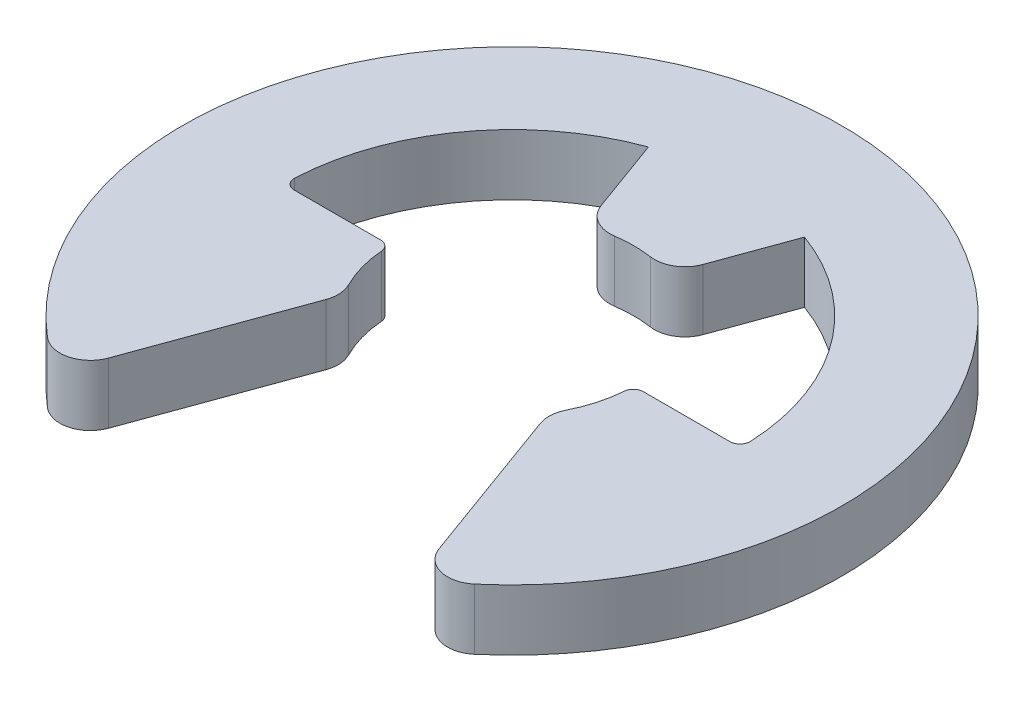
ISO-10303-21;
HEADER;
FILE_DESCRIPTION(('STEP AP214'),'2;1');
FILE_NAME('part.step','',(''),(''),'','','');
FILE_SCHEMA(('AUTOMOTIVE_DESIGN { 1 0 10303 214 1 1 1 1 }'));
ENDSEC;
DATA;
#1=APPLICATION_CONTEXT('core data for automotive mechanical design processes');
#2=APPLICATION_PROTOCOL_DEFINITION('international standard','automotive_design',2000,#1);
#3=PRODUCT_CONTEXT('',#1,'mechanical');
#4=PRODUCT('Part','Part','',(#3));
#5=PRODUCT_RELATED_PRODUCT_CATEGORY('part','',(#4));
#6=PRODUCT_DEFINITION_FORMATION('','',#4);
#7=PRODUCT_DEFINITION_CONTEXT('part definition',#1,'design');
#8=PRODUCT_DEFINITION('design','',#6,#7);
#9=PRODUCT_DEFINITION_SHAPE('','',#8);
#10=(LENGTH_UNIT() NAMED_UNIT(*) SI_UNIT(.MILLI.,.METRE.));
#11=(NAMED_UNIT(*) PLANE_ANGLE_UNIT() SI_UNIT($,.RADIAN.));
#12=(NAMED_UNIT(*) SI_UNIT($,.STERADIAN.) SOLID_ANGLE_UNIT());
#13=UNCERTAINTY_MEASURE_WITH_UNIT(LENGTH_MEASURE(1.E-05),#10,'distance_accuracy_value','');
#14=(GEOMETRIC_REPRESENTATION_CONTEXT(3) GLOBAL_UNCERTAINTY_ASSIGNED_CONTEXT((#13)) GLOBAL_UNIT_ASSIGNED_CONTEXT((#10,
#11,#12)) REPRESENTATION_CONTEXT('',''));
#15=CARTESIAN_POINT('',(0.,0.,0.));
#16=DIRECTION('',(0.,0.,1.));
#17=DIRECTION('',(1.,0.,0.));
#18=AXIS2_PLACEMENT_3D('',#15,#16,#17);
#19=CARTESIAN_POINT('',(0.,0.15,0.));
#20=DIRECTION('',(0.,-1.,0.));
#21=DIRECTION('',(0.,0.,-1.));
#22=AXIS2_PLACEMENT_3D('',#19,#20,#21);
#23=CYLINDRICAL_SURFACE('',#22,1.125);
#24=CARTESIAN_POINT('',(0.,0.15,0.));
#25=DIRECTION('',(0.,-1.,0.));
#26=DIRECTION('',(0.,0.,1.));
#27=AXIS2_PLACEMENT_3D('',#24,#25,#26);
#28=CIRCLE('',#27,1.125);
#29=CARTESIAN_POINT('',(-1.12378246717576,0.15,-0.0523255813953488));
#30=VERTEX_POINT('',#29);
#31=CARTESIAN_POINT('',(-0.38477266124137,0.15,-1.05715419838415));
#32=VERTEX_POINT('',#31);
#33=EDGE_CURVE('E187',#30,#32,#28,.T.);
#34=ORIENTED_EDGE('',*,*,#33,.F.);
#35=DIRECTION('',(0.,-1.,0.));
#36=VECTOR('',#35,1.);
#37=CARTESIAN_POINT('',(-1.12378246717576,0.15,-0.0523255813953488));
#38=LINE('',#37,#36);
#39=CARTESIAN_POINT('',(-1.12378246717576,-0.15,-0.0523255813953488));
#40=VERTEX_POINT('',#39);
#41=EDGE_CURVE('E329',#30,#40,#38,.T.);
#42=ORIENTED_EDGE('',*,*,#41,.T.);
#43=CARTESIAN_POINT('',(0.,-0.15,0.));
#44=DIRECTION('',(0.,-1.,0.));
#45=DIRECTION('',(0.,0.,1.));
#46=AXIS2_PLACEMENT_3D('',#43,#44,#45);
#47=CIRCLE('',#46,1.125);
#48=CARTESIAN_POINT('',(-0.38477266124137,-0.15,-1.05715419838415));
#49=VERTEX_POINT('',#48);
#50=EDGE_CURVE('E211',#40,#49,#47,.T.);
#51=ORIENTED_EDGE('',*,*,#50,.T.);
#52=DIRECTION('',(0.,-1.,0.));
#53=VECTOR('',#52,1.);
#54=CARTESIAN_POINT('',(-0.38477266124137,0.15,-1.05715419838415));
#55=LINE('',#54,#53);
#56=EDGE_CURVE('E204',#32,#49,#55,.T.);
#57=ORIENTED_EDGE('',*,*,#56,.F.);
#58=EDGE_LOOP('',(#34,#42,#51,#57));
#59=FACE_BOUND('',#58,.T.);
#60=ADVANCED_FACE('F39',(#59),#23,.F.);
#61=CARTESIAN_POINT('',(-0.38477266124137,0.15,-1.05715419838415));
#62=DIRECTION('',(0.939692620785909,0.,-0.342020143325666));
#63=DIRECTION('',(-0.342020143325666,0.,-0.939692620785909));
#64=AXIS2_PLACEMENT_3D('',#61,#62,#63);
#65=PLANE('',#64);
#66=DIRECTION('',(0.342020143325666,0.,0.939692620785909));
#67=VECTOR('',#66,1.);
#68=CARTESIAN_POINT('',(-0.38477266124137,-0.15,-1.05715419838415));
#69=LINE('',#68,#67);
#70=CARTESIAN_POINT('',(-0.251332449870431,-0.15,-0.690530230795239));
#71=VERTEX_POINT('',#70);
#72=EDGE_CURVE('E447',#49,#71,#69,.T.);
#73=ORIENTED_EDGE('',*,*,#72,.T.);
#74=DIRECTION('',(0.,-1.,0.));
#75=VECTOR('',#74,1.);
#76=CARTESIAN_POINT('',(-0.251332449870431,0.15,-0.690530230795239));
#77=LINE('',#76,#75);
#78=CARTESIAN_POINT('',(-0.251332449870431,0.15,-0.690530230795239));
#79=VERTEX_POINT('',#78);
#80=EDGE_CURVE('E206',#71,#79,#77,.F.);
#81=ORIENTED_EDGE('',*,*,#80,.T.);
#82=DIRECTION('',(0.342020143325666,0.,0.939692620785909));
#83=VECTOR('',#82,1.);
#84=CARTESIAN_POINT('',(-0.38477266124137,0.15,-1.05715419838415));
#85=LINE('',#84,#83);
#86=EDGE_CURVE('E191',#32,#79,#85,.T.);
#87=ORIENTED_EDGE('',*,*,#86,.F.);
#88=ORIENTED_EDGE('',*,*,#56,.T.);
#89=EDGE_LOOP('',(#73,#81,#87,#88));
#90=FACE_BOUND('',#89,.T.);
#91=ADVANCED_FACE('F203',(#90),#65,.F.);
#92=CARTESIAN_POINT('',(0.,0.15,0.));
#93=DIRECTION('',(0.,-1.,0.));
#94=DIRECTION('',(0.,0.,-1.));
#95=AXIS2_PLACEMENT_3D('',#92,#93,#94);
#96=CYLINDRICAL_SURFACE('',#95,0.6);
#97=CARTESIAN_POINT('',(0.,-0.15,0.));
#98=DIRECTION('',(0.,-1.,0.));
#99=DIRECTION('',(0.,0.,1.));
#100=AXIS2_PLACEMENT_3D('',#97,#98,#99);
#101=CIRCLE('',#100,0.6);
#102=CARTESIAN_POINT('',(-0.0883028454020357,-0.15,-0.593466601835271));
#103=VERTEX_POINT('',#102);
#104=CARTESIAN_POINT('',(0.0883028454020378,-0.15,-0.59346660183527));
#105=VERTEX_POINT('',#104);
#106=EDGE_CURVE('E450',#103,#105,#101,.T.);
#107=ORIENTED_EDGE('',*,*,#106,.T.);
#108=DIRECTION('',(0.,-1.,0.));
#109=VECTOR('',#108,1.);
#110=CARTESIAN_POINT('',(0.0883028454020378,0.15,-0.59346660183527));
#111=LINE('',#110,#109);
#112=CARTESIAN_POINT('',(0.0883028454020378,0.15,-0.59346660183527));
#113=VERTEX_POINT('',#112);
#114=EDGE_CURVE('E291',#105,#113,#111,.F.);
#115=ORIENTED_EDGE('',*,*,#114,.T.);
#116=CARTESIAN_POINT('',(0.,0.15,0.));
#117=DIRECTION('',(0.,-1.,0.));
#118=DIRECTION('',(0.,0.,1.));
#119=AXIS2_PLACEMENT_3D('',#116,#117,#118);
#120=CIRCLE('',#119,0.6);
#121=CARTESIAN_POINT('',(-0.0883028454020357,0.15,-0.593466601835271));
#122=VERTEX_POINT('',#121);
#123=EDGE_CURVE('E208',#122,#113,#120,.T.);
#124=ORIENTED_EDGE('',*,*,#123,.F.);
#125=DIRECTION('',(0.,-1.,0.));
#126=VECTOR('',#125,1.);
#127=CARTESIAN_POINT('',(-0.0883028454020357,0.15,-0.593466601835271));
#128=LINE('',#127,#126);
#129=EDGE_CURVE('E287',#122,#103,#128,.T.);
#130=ORIENTED_EDGE('',*,*,#129,.T.);
#131=EDGE_LOOP('',(#107,#115,#124,#130));
#132=FACE_BOUND('',#131,.T.);
#133=ADVANCED_FACE('F373',(#132),#96,.F.);
#134=CARTESIAN_POINT('',(0.205212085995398,0.15,-0.563815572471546));
#135=DIRECTION('',(-0.939692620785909,0.,-0.342020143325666));
#136=DIRECTION('',(-0.342020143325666,0.,0.939692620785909));
#137=AXIS2_PLACEMENT_3D('',#134,#135,#136);
#138=PLANE('',#137);
#139=DIRECTION('',(0.342020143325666,0.,-0.939692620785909));
#140=VECTOR('',#139,1.);
#141=CARTESIAN_POINT('',(0.205212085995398,0.15,-0.563815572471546));
#142=LINE('',#141,#140);
#143=CARTESIAN_POINT('',(0.251332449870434,0.15,-0.690530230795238));
#144=VERTEX_POINT('',#143);
#145=CARTESIAN_POINT('',(0.384772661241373,0.15,-1.05715419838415));
#146=VERTEX_POINT('',#145);
#147=EDGE_CURVE('E425',#144,#146,#142,.T.);
#148=ORIENTED_EDGE('',*,*,#147,.F.);
#149=DIRECTION('',(0.,-1.,0.));
#150=VECTOR('',#149,1.);
#151=CARTESIAN_POINT('',(0.251332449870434,0.15,-0.690530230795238));
#152=LINE('',#151,#150);
#153=CARTESIAN_POINT('',(0.251332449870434,-0.15,-0.690530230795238));
#154=VERTEX_POINT('',#153);
#155=EDGE_CURVE('E283',#144,#154,#152,.T.);
#156=ORIENTED_EDGE('',*,*,#155,.T.);
#157=DIRECTION('',(0.342020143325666,0.,-0.939692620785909));
#158=VECTOR('',#157,1.);
#159=CARTESIAN_POINT('',(0.205212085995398,-0.15,-0.563815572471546));
#160=LINE('',#159,#158);
#161=CARTESIAN_POINT('',(0.384772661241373,-0.15,-1.05715419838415));
#162=VERTEX_POINT('',#161);
#163=EDGE_CURVE('E454',#154,#162,#160,.T.);
#164=ORIENTED_EDGE('',*,*,#163,.T.);
#165=DIRECTION('',(0.,-1.,0.));
#166=VECTOR('',#165,1.);
#167=CARTESIAN_POINT('',(0.384772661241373,0.15,-1.05715419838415));
#168=LINE('',#167,#166);
#169=EDGE_CURVE('E215',#146,#162,#168,.T.);
#170=ORIENTED_EDGE('',*,*,#169,.F.);
#171=EDGE_LOOP('',(#148,#156,#164,#170));
#172=FACE_BOUND('',#171,.T.);
#173=ADVANCED_FACE('F528',(#172),#138,.F.);
#174=CARTESIAN_POINT('',(0.,0.15,0.));
#175=DIRECTION('',(0.,-1.,0.));
#176=DIRECTION('',(0.,0.,-1.));
#177=AXIS2_PLACEMENT_3D('',#174,#175,#176);
#178=CYLINDRICAL_SURFACE('',#177,1.125);
#179=CARTESIAN_POINT('',(0.,-0.15,0.));
#180=DIRECTION('',(0.,-1.,0.));
#181=DIRECTION('',(0.,0.,1.));
#182=AXIS2_PLACEMENT_3D('',#179,#180,#181);
#183=CIRCLE('',#182,1.125);
#184=CARTESIAN_POINT('',(1.12378246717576,-0.15,-0.0523255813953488));
#185=VERTEX_POINT('',#184);
#186=EDGE_CURVE('E457',#162,#185,#183,.T.);
#187=ORIENTED_EDGE('',*,*,#186,.T.);
#188=DIRECTION('',(0.,-1.,0.));
#189=VECTOR('',#188,1.);
#190=CARTESIAN_POINT('',(1.12378246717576,0.15,-0.0523255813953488));
#191=LINE('',#190,#189);
#192=CARTESIAN_POINT('',(1.12378246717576,0.15,-0.0523255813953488));
#193=VERTEX_POINT('',#192);
#194=EDGE_CURVE('E310',#185,#193,#191,.F.);
#195=ORIENTED_EDGE('',*,*,#194,.T.);
#196=CARTESIAN_POINT('',(0.,0.15,0.));
#197=DIRECTION('',(0.,-1.,0.));
#198=DIRECTION('',(0.,0.,1.));
#199=AXIS2_PLACEMENT_3D('',#196,#197,#198);
#200=CIRCLE('',#199,1.125);
#201=EDGE_CURVE('E413',#146,#193,#200,.T.);
#202=ORIENTED_EDGE('',*,*,#201,.F.);
#203=ORIENTED_EDGE('',*,*,#169,.T.);
#204=EDGE_LOOP('',(#187,#195,#202,#203));
#205=FACE_BOUND('',#204,.T.);
#206=ADVANCED_FACE('F522',(#205),#178,.F.);
#207=CARTESIAN_POINT('',(0.6,0.15,0.));
#208=DIRECTION('',(0.,0.,1.));
#209=DIRECTION('',(1.,0.,0.));
#210=AXIS2_PLACEMENT_3D('',#207,#208,#209);
#211=PLANE('',#210);
#212=DIRECTION('',(-1.,0.,0.));
#213=VECTOR('',#212,1.);
#214=CARTESIAN_POINT('',(0.6,0.15,0.));
#215=LINE('',#214,#213);
#216=CARTESIAN_POINT('',(1.07383657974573,0.15,0.));
#217=VERTEX_POINT('',#216);
#218=CARTESIAN_POINT('',(0.648074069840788,0.15,0.));
#219=VERTEX_POINT('',#218);
#220=EDGE_CURVE('E410',#217,#219,#215,.T.);
#221=ORIENTED_EDGE('',*,*,#220,.F.);
#222=DIRECTION('',(0.,1.,0.));
#223=VECTOR('',#222,1.);
#224=CARTESIAN_POINT('',(1.07383657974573,-0.15,0.));
#225=LINE('',#224,#223);
#226=CARTESIAN_POINT('',(1.07383657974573,-0.15,0.));
#227=VERTEX_POINT('',#226);
#228=EDGE_CURVE('E306',#217,#227,#225,.F.);
#229=ORIENTED_EDGE('',*,*,#228,.T.);
#230=DIRECTION('',(-1.,0.,0.));
#231=VECTOR('',#230,1.);
#232=CARTESIAN_POINT('',(0.6,-0.15,0.));
#233=LINE('',#232,#231);
#234=CARTESIAN_POINT('',(0.648074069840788,-0.15,0.));
#235=VERTEX_POINT('',#234);
#236=EDGE_CURVE('E461',#227,#235,#233,.T.);
#237=ORIENTED_EDGE('',*,*,#236,.T.);
#238=DIRECTION('',(0.,-1.,0.));
#239=VECTOR('',#238,1.);
#240=CARTESIAN_POINT('',(0.648074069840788,0.15,0.));
#241=LINE('',#240,#239);
#242=EDGE_CURVE('E303',#235,#219,#241,.F.);
#243=ORIENTED_EDGE('',*,*,#242,.T.);
#244=EDGE_LOOP('',(#221,#229,#237,#243));
#245=FACE_BOUND('',#244,.T.);
#246=ADVANCED_FACE('F415',(#245),#211,.F.);
#247=CARTESIAN_POINT('',(0.,0.15,0.));
#248=DIRECTION('',(0.,-1.,0.));
#249=DIRECTION('',(0.,0.,-1.));
#250=AXIS2_PLACEMENT_3D('',#247,#248,#249);
#251=CYLINDRICAL_SURFACE('',#250,0.600000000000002);
#252=CARTESIAN_POINT('',(0.,0.15,0.));
#253=DIRECTION('',(0.,-1.,0.));
#254=DIRECTION('',(0.,0.,1.));
#255=AXIS2_PLACEMENT_3D('',#252,#253,#254);
#256=CIRCLE('',#255,0.600000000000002);
#257=CARTESIAN_POINT('',(0.598222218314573,0.15,0.0461538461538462));
#258=VERTEX_POINT('',#257);
#259=CARTESIAN_POINT('',(0.535710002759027,0.15,0.270212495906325));
#260=VERTEX_POINT('',#259);
#261=EDGE_CURVE('E420',#258,#260,#256,.T.);
#262=ORIENTED_EDGE('',*,*,#261,.F.);
#263=DIRECTION('',(0.,-1.,0.));
#264=VECTOR('',#263,1.);
#265=CARTESIAN_POINT('',(0.598222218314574,0.15,0.0461538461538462));
#266=LINE('',#265,#264);
#267=CARTESIAN_POINT('',(0.598222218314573,-0.15,0.0461538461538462));
#268=VERTEX_POINT('',#267);
#269=EDGE_CURVE('E313',#258,#268,#266,.T.);
#270=ORIENTED_EDGE('',*,*,#269,.T.);
#271=CARTESIAN_POINT('',(0.,-0.15,0.));
#272=DIRECTION('',(0.,-1.,0.));
#273=DIRECTION('',(0.,0.,1.));
#274=AXIS2_PLACEMENT_3D('',#271,#272,#273);
#275=CIRCLE('',#274,0.600000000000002);
#276=CARTESIAN_POINT('',(0.535710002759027,-0.15,0.270212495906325));
#277=VERTEX_POINT('',#276);
#278=EDGE_CURVE('E464',#268,#277,#275,.T.);
#279=ORIENTED_EDGE('',*,*,#278,.T.);
#280=DIRECTION('',(0.,-1.,0.));
#281=VECTOR('',#280,1.);
#282=CARTESIAN_POINT('',(0.535710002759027,0.15,0.270212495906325));
#283=LINE('',#282,#281);
#284=EDGE_CURVE('E250',#277,#260,#283,.F.);
#285=ORIENTED_EDGE('',*,*,#284,.T.);
#286=EDGE_LOOP('',(#262,#270,#279,#285));
#287=FACE_BOUND('',#286,.T.);
#288=ADVANCED_FACE('F513',(#287),#251,.F.);
#289=CARTESIAN_POINT('',(0.505,0.15,0.323998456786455));
#290=DIRECTION('',(0.93969262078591,0.,-0.342020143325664));
#291=DIRECTION('',(-0.342020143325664,0.,-0.93969262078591));
#292=AXIS2_PLACEMENT_3D('',#289,#290,#291);
#293=PLANE('',#292);
#294=DIRECTION('',(0.342020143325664,0.,0.93969262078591));
#295=VECTOR('',#294,1.);
#296=CARTESIAN_POINT('',(0.505,0.15,0.323998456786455));
#297=LINE('',#296,#295);
#298=CARTESIAN_POINT('',(0.528683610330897,0.15,0.389068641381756));
#299=VERTEX_POINT('',#298);
#300=CARTESIAN_POINT('',(0.814687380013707,0.15,1.17485754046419));
#301=VERTEX_POINT('',#300);
#302=EDGE_CURVE('E422',#299,#301,#297,.T.);
#303=ORIENTED_EDGE('',*,*,#302,.F.);
#304=DIRECTION('',(0.,-1.,0.));
#305=VECTOR('',#304,1.);
#306=CARTESIAN_POINT('',(0.528683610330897,0.15,0.389068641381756));
#307=LINE('',#306,#305);
#308=CARTESIAN_POINT('',(0.528683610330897,-0.15,0.389068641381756));
#309=VERTEX_POINT('',#308);
#310=EDGE_CURVE('E220',#299,#309,#307,.T.);
#311=ORIENTED_EDGE('',*,*,#310,.T.);
#312=DIRECTION('',(0.342020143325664,0.,0.93969262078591));
#313=VECTOR('',#312,1.);
#314=CARTESIAN_POINT('',(0.505,-0.15,0.323998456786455));
#315=LINE('',#314,#313);
#316=CARTESIAN_POINT('',(0.814687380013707,-0.15,1.17485754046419));
#317=VERTEX_POINT('',#316);
#318=EDGE_CURVE('E467',#309,#317,#315,.T.);
#319=ORIENTED_EDGE('',*,*,#318,.T.);
#320=DIRECTION('',(0.,-1.,0.));
#321=VECTOR('',#320,1.);
#322=CARTESIAN_POINT('',(0.814687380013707,0.15,1.17485754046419));
#323=LINE('',#322,#321);
#324=EDGE_CURVE('E214',#317,#301,#323,.F.);
#325=ORIENTED_EDGE('',*,*,#324,.T.);
#326=EDGE_LOOP('',(#303,#311,#319,#325));
#327=FACE_BOUND('',#326,.T.);
#328=ADVANCED_FACE('F507',(#327),#293,.F.);
#329=CARTESIAN_POINT('',(0.,0.15,0.));
#330=DIRECTION('',(0.,-1.,0.));
#331=DIRECTION('',(0.,0.,-1.));
#332=AXIS2_PLACEMENT_3D('',#329,#330,#331);
#333=CYLINDRICAL_SURFACE('',#332,1.625);
#334=CARTESIAN_POINT('',(0.,0.15,0.));
#335=DIRECTION('',(0.,1.,0.));
#336=DIRECTION('',(0.,0.,1.));
#337=AXIS2_PLACEMENT_3D('',#334,#335,#336);
#338=CIRCLE('',#337,1.625);
#339=CARTESIAN_POINT('',(1.05282513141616,0.15,1.23781430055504));
#340=VERTEX_POINT('',#339);
#341=CARTESIAN_POINT('',(-1.05282513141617,0.15,1.23781430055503));
#342=VERTEX_POINT('',#341);
#343=EDGE_CURVE('E432',#340,#342,#338,.T.);
#344=ORIENTED_EDGE('',*,*,#343,.F.);
#345=DIRECTION('',(0.,-1.,0.));
#346=VECTOR('',#345,1.);
#347=CARTESIAN_POINT('',(1.05282513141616,0.15,1.23781430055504));
#348=LINE('',#347,#346);
#349=CARTESIAN_POINT('',(1.05282513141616,-0.15,1.23781430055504));
#350=VERTEX_POINT('',#349);
#351=EDGE_CURVE('E299',#340,#350,#348,.T.);
#352=ORIENTED_EDGE('',*,*,#351,.T.);
#353=CARTESIAN_POINT('',(0.,-0.15,0.));
#354=DIRECTION('',(0.,1.,0.));
#355=DIRECTION('',(0.,0.,1.));
#356=AXIS2_PLACEMENT_3D('',#353,#354,#355);
#357=CIRCLE('',#356,1.625);
#358=CARTESIAN_POINT('',(-1.05282513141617,-0.15,1.23781430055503));
#359=VERTEX_POINT('',#358);
#360=EDGE_CURVE('E471',#350,#359,#357,.T.);
#361=ORIENTED_EDGE('',*,*,#360,.T.);
#362=DIRECTION('',(0.,-1.,0.));
#363=VECTOR('',#362,1.);
#364=CARTESIAN_POINT('',(-1.05282513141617,0.15,1.23781430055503));
#365=LINE('',#364,#363);
#366=EDGE_CURVE('E296',#359,#342,#365,.F.);
#367=ORIENTED_EDGE('',*,*,#366,.T.);
#368=EDGE_LOOP('',(#344,#352,#361,#367));
#369=FACE_BOUND('',#368,.T.);
#370=ADVANCED_FACE('F500',(#369),#333,.T.);
#371=CARTESIAN_POINT('',(-0.883476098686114,0.15,1.36385299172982));
#372=DIRECTION('',(-0.939692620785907,0.,-0.342020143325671));
#373=DIRECTION('',(-0.342020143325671,0.,0.939692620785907));
#374=AXIS2_PLACEMENT_3D('',#371,#372,#373);
#375=PLANE('',#374);
#376=DIRECTION('',(0.342020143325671,0.,-0.939692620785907));
#377=VECTOR('',#376,1.);
#378=CARTESIAN_POINT('',(-0.883476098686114,-0.15,1.36385299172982));
#379=LINE('',#378,#377);
#380=CARTESIAN_POINT('',(-0.814687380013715,-0.15,1.17485754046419));
#381=VERTEX_POINT('',#380);
#382=CARTESIAN_POINT('',(-0.528683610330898,-0.15,0.389068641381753));
#383=VERTEX_POINT('',#382);
#384=EDGE_CURVE('E475',#381,#383,#379,.T.);
#385=ORIENTED_EDGE('',*,*,#384,.T.);
#386=DIRECTION('',(0.,-1.,0.));
#387=VECTOR('',#386,1.);
#388=CARTESIAN_POINT('',(-0.528683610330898,0.15,0.389068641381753));
#389=LINE('',#388,#387);
#390=CARTESIAN_POINT('',(-0.528683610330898,0.15,0.389068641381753));
#391=VERTEX_POINT('',#390);
#392=EDGE_CURVE('E280',#383,#391,#389,.F.);
#393=ORIENTED_EDGE('',*,*,#392,.T.);
#394=DIRECTION('',(0.342020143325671,0.,-0.939692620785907));
#395=VECTOR('',#394,1.);
#396=CARTESIAN_POINT('',(-0.883476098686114,0.15,1.36385299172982));
#397=LINE('',#396,#395);
#398=CARTESIAN_POINT('',(-0.814687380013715,0.15,1.17485754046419));
#399=VERTEX_POINT('',#398);
#400=EDGE_CURVE('E435',#399,#391,#397,.T.);
#401=ORIENTED_EDGE('',*,*,#400,.F.);
#402=DIRECTION('',(0.,-1.,0.));
#403=VECTOR('',#402,1.);
#404=CARTESIAN_POINT('',(-0.814687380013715,0.15,1.17485754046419));
#405=LINE('',#404,#403);
#406=EDGE_CURVE('E276',#399,#381,#405,.T.);
#407=ORIENTED_EDGE('',*,*,#406,.T.);
#408=EDGE_LOOP('',(#385,#393,#401,#407));
#409=FACE_BOUND('',#408,.T.);
#410=ADVANCED_FACE('F492',(#409),#375,.F.);
#411=CARTESIAN_POINT('',(0.,0.15,0.));
#412=DIRECTION('',(0.,-1.,0.));
#413=DIRECTION('',(0.,0.,-1.));
#414=AXIS2_PLACEMENT_3D('',#411,#412,#413);
#415=CYLINDRICAL_SURFACE('',#414,0.600000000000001);
#416=CARTESIAN_POINT('',(0.,-0.15,0.));
#417=DIRECTION('',(0.,-1.,0.));
#418=DIRECTION('',(0.,0.,1.));
#419=AXIS2_PLACEMENT_3D('',#416,#417,#418);
#420=CIRCLE('',#419,0.600000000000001);
#421=CARTESIAN_POINT('',(-0.535710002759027,-0.15,0.270212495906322));
#422=VERTEX_POINT('',#421);
#423=CARTESIAN_POINT('',(-0.598222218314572,-0.15,0.0461538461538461));
#424=VERTEX_POINT('',#423);
#425=EDGE_CURVE('E356',#422,#424,#420,.T.);
#426=ORIENTED_EDGE('',*,*,#425,.T.);
#427=DIRECTION('',(0.,-1.,0.));
#428=VECTOR('',#427,1.);
#429=CARTESIAN_POINT('',(-0.598222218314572,0.15,0.0461538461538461));
#430=LINE('',#429,#428);
#431=CARTESIAN_POINT('',(-0.598222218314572,0.15,0.0461538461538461));
#432=VERTEX_POINT('',#431);
#433=EDGE_CURVE('E338',#424,#432,#430,.F.);
#434=ORIENTED_EDGE('',*,*,#433,.T.);
#435=CARTESIAN_POINT('',(0.,0.15,0.));
#436=DIRECTION('',(0.,-1.,0.));
#437=DIRECTION('',(0.,0.,1.));
#438=AXIS2_PLACEMENT_3D('',#435,#436,#437);
#439=CIRCLE('',#438,0.600000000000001);
#440=CARTESIAN_POINT('',(-0.535710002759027,0.15,0.270212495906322));
#441=VERTEX_POINT('',#440);
#442=EDGE_CURVE('E439',#441,#432,#439,.T.);
#443=ORIENTED_EDGE('',*,*,#442,.F.);
#444=DIRECTION('',(0.,-1.,0.));
#445=VECTOR('',#444,1.);
#446=CARTESIAN_POINT('',(-0.535710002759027,0.15,0.270212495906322));
#447=LINE('',#446,#445);
#448=EDGE_CURVE('E272',#441,#422,#447,.T.);
#449=ORIENTED_EDGE('',*,*,#448,.T.);
#450=EDGE_LOOP('',(#426,#434,#443,#449));
#451=FACE_BOUND('',#450,.T.);
#452=ADVANCED_FACE('F484',(#451),#415,.F.);
#453=CARTESIAN_POINT('',(-0.6,0.15,0.));
#454=DIRECTION('',(0.,0.,1.));
#455=DIRECTION('',(1.,0.,0.));
#456=AXIS2_PLACEMENT_3D('',#453,#454,#455);
#457=PLANE('',#456);
#458=DIRECTION('',(-1.,0.,0.));
#459=VECTOR('',#458,1.);
#460=CARTESIAN_POINT('',(-0.6,-0.15,0.));
#461=LINE('',#460,#459);
#462=CARTESIAN_POINT('',(-0.648074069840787,-0.15,0.));
#463=VERTEX_POINT('',#462);
#464=CARTESIAN_POINT('',(-1.07383657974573,-0.15,0.));
#465=VERTEX_POINT('',#464);
#466=EDGE_CURVE('E198',#463,#465,#461,.T.);
#467=ORIENTED_EDGE('',*,*,#466,.T.);
#468=DIRECTION('',(0.,1.,0.));
#469=VECTOR('',#468,1.);
#470=CARTESIAN_POINT('',(-1.07383657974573,0.15,0.));
#471=LINE('',#470,#469);
#472=CARTESIAN_POINT('',(-1.07383657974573,0.15,0.));
#473=VERTEX_POINT('',#472);
#474=EDGE_CURVE('E61',#465,#473,#471,.T.);
#475=ORIENTED_EDGE('',*,*,#474,.T.);
#476=DIRECTION('',(-1.,0.,0.));
#477=VECTOR('',#476,1.);
#478=CARTESIAN_POINT('',(-0.6,0.15,0.));
#479=LINE('',#478,#477);
#480=CARTESIAN_POINT('',(-0.648074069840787,0.15,0.));
#481=VERTEX_POINT('',#480);
#482=EDGE_CURVE('E224',#481,#473,#479,.T.);
#483=ORIENTED_EDGE('',*,*,#482,.F.);
#484=DIRECTION('',(0.,-1.,0.));
#485=VECTOR('',#484,1.);
#486=CARTESIAN_POINT('',(-0.648074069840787,0.15,0.));
#487=LINE('',#486,#485);
#488=EDGE_CURVE('E332',#481,#463,#487,.T.);
#489=ORIENTED_EDGE('',*,*,#488,.T.);
#490=EDGE_LOOP('',(#467,#475,#483,#489));
#491=FACE_BOUND('',#490,.T.);
#492=ADVANCED_FACE('F353',(#491),#457,.F.);
#493=CARTESIAN_POINT('',(0.,0.15,0.));
#494=DIRECTION('',(0.,1.,0.));
#495=DIRECTION('',(0.,0.,1.));
#496=AXIS2_PLACEMENT_3D('',#493,#494,#495);
#497=PLANE('',#496);
#498=ORIENTED_EDGE('',*,*,#220,.T.);
#499=CARTESIAN_POINT('',(0.648074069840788,0.15,0.05));
#500=DIRECTION('',(0.,1.,0.));
#501=DIRECTION('',(0.,0.,1.));
#502=AXIS2_PLACEMENT_3D('',#499,#500,#501);
#503=CIRCLE('',#502,0.05);
#504=EDGE_CURVE('E326',#219,#258,#503,.T.);
#505=ORIENTED_EDGE('',*,*,#504,.T.);
#506=ORIENTED_EDGE('',*,*,#261,.T.);
#507=CARTESIAN_POINT('',(0.669637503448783,0.15,0.337765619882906));
#508=DIRECTION('',(0.,1.,0.));
#509=DIRECTION('',(0.,0.,1.));
#510=AXIS2_PLACEMENT_3D('',#507,#508,#509);
#511=CIRCLE('',#510,0.15);
#512=EDGE_CURVE('E269',#260,#299,#511,.T.);
#513=ORIENTED_EDGE('',*,*,#512,.T.);
#514=ORIENTED_EDGE('',*,*,#302,.T.);
#515=CARTESIAN_POINT('',(0.955641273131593,0.15,1.12355451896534));
#516=DIRECTION('',(0.,1.,0.));
#517=DIRECTION('',(0.,0.,1.));
#518=AXIS2_PLACEMENT_3D('',#515,#516,#517);
#519=CIRCLE('',#518,0.15);
#520=EDGE_CURVE('E257',#301,#340,#519,.T.);
#521=ORIENTED_EDGE('',*,*,#520,.T.);
#522=ORIENTED_EDGE('',*,*,#343,.T.);
#523=CARTESIAN_POINT('',(-0.955641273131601,0.15,1.12355451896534));
#524=DIRECTION('',(0.,1.,0.));
#525=DIRECTION('',(0.,0.,1.));
#526=AXIS2_PLACEMENT_3D('',#523,#524,#525);
#527=CIRCLE('',#526,0.15);
#528=EDGE_CURVE('E254',#342,#399,#527,.T.);
#529=ORIENTED_EDGE('',*,*,#528,.T.);
#530=ORIENTED_EDGE('',*,*,#400,.T.);
#531=CARTESIAN_POINT('',(-0.669637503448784,0.15,0.337765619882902));
#532=DIRECTION('',(0.,1.,0.));
#533=DIRECTION('',(0.,0.,1.));
#534=AXIS2_PLACEMENT_3D('',#531,#532,#533);
#535=CIRCLE('',#534,0.15);
#536=EDGE_CURVE('E266',#391,#441,#535,.T.);
#537=ORIENTED_EDGE('',*,*,#536,.T.);
#538=ORIENTED_EDGE('',*,*,#442,.T.);
#539=CARTESIAN_POINT('',(-0.648074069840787,0.15,0.05));
#540=DIRECTION('',(0.,1.,0.));
#541=DIRECTION('',(0.,0.,1.));
#542=AXIS2_PLACEMENT_3D('',#539,#540,#541);
#543=CIRCLE('',#542,0.05);
#544=EDGE_CURVE('E323',#432,#481,#543,.T.);
#545=ORIENTED_EDGE('',*,*,#544,.T.);
#546=ORIENTED_EDGE('',*,*,#482,.T.);
#547=CARTESIAN_POINT('',(-1.07383657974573,0.15,-0.05));
#548=DIRECTION('',(0.,1.,0.));
#549=DIRECTION('',(0.,0.,1.));
#550=AXIS2_PLACEMENT_3D('',#547,#548,#549);
#551=CIRCLE('',#550,0.05);
#552=EDGE_CURVE('E11',#473,#30,#551,.F.);
#553=ORIENTED_EDGE('',*,*,#552,.T.);
#554=ORIENTED_EDGE('',*,*,#33,.T.);
#555=ORIENTED_EDGE('',*,*,#86,.T.);
#556=CARTESIAN_POINT('',(-0.110378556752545,0.15,-0.741833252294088));
#557=DIRECTION('',(0.,1.,0.));
#558=DIRECTION('',(0.,0.,1.));
#559=AXIS2_PLACEMENT_3D('',#556,#557,#558);
#560=CIRCLE('',#559,0.15);
#561=EDGE_CURVE('E260',#79,#122,#560,.T.);
#562=ORIENTED_EDGE('',*,*,#561,.T.);
#563=ORIENTED_EDGE('',*,*,#123,.T.);
#564=CARTESIAN_POINT('',(0.110378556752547,0.15,-0.741833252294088));
#565=DIRECTION('',(0.,1.,0.));
#566=DIRECTION('',(0.,0.,1.));
#567=AXIS2_PLACEMENT_3D('',#564,#565,#566);
#568=CIRCLE('',#567,0.15);
#569=EDGE_CURVE('E263',#113,#144,#568,.T.);
#570=ORIENTED_EDGE('',*,*,#569,.T.);
#571=ORIENTED_EDGE('',*,*,#147,.T.);
#572=ORIENTED_EDGE('',*,*,#201,.T.);
#573=CARTESIAN_POINT('',(1.07383657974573,0.15,-0.05));
#574=DIRECTION('',(0.,1.,0.));
#575=DIRECTION('',(0.,0.,1.));
#576=AXIS2_PLACEMENT_3D('',#573,#574,#575);
#577=CIRCLE('',#576,0.05);
#578=EDGE_CURVE('E344',#193,#217,#577,.F.);
#579=ORIENTED_EDGE('',*,*,#578,.T.);
#580=EDGE_LOOP('',(#498,#505,#506,#513,#514,#521,#522,#529,#530,#537,#538,#545,#546,#553,#554,
#555,#562,#563,#570,#571,#572,#579));
#581=FACE_BOUND('',#580,.T.);
#582=ADVANCED_FACE('F190',(#581),#497,.T.);
#583=CARTESIAN_POINT('',(0.,-0.15,0.));
#584=DIRECTION('',(0.,1.,0.));
#585=DIRECTION('',(0.,0.,1.));
#586=AXIS2_PLACEMENT_3D('',#583,#584,#585);
#587=PLANE('',#586);
#588=ORIENTED_EDGE('',*,*,#278,.F.);
#589=CARTESIAN_POINT('',(0.648074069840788,-0.15,0.05));
#590=DIRECTION('',(0.,1.,0.));
#591=DIRECTION('',(0.,0.,1.));
#592=AXIS2_PLACEMENT_3D('',#589,#590,#591);
#593=CIRCLE('',#592,0.05);
#594=EDGE_CURVE('E320',#268,#235,#593,.F.);
#595=ORIENTED_EDGE('',*,*,#594,.T.);
#596=ORIENTED_EDGE('',*,*,#236,.F.);
#597=CARTESIAN_POINT('',(1.07383657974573,-0.15,-0.05));
#598=DIRECTION('',(0.,1.,0.));
#599=DIRECTION('',(0.,0.,1.));
#600=AXIS2_PLACEMENT_3D('',#597,#598,#599);
#601=CIRCLE('',#600,0.05);
#602=EDGE_CURVE('E341',#227,#185,#601,.T.);
#603=ORIENTED_EDGE('',*,*,#602,.T.);
#604=ORIENTED_EDGE('',*,*,#186,.F.);
#605=ORIENTED_EDGE('',*,*,#163,.F.);
#606=CARTESIAN_POINT('',(0.110378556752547,-0.15,-0.741833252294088));
#607=DIRECTION('',(0.,1.,0.));
#608=DIRECTION('',(0.,0.,1.));
#609=AXIS2_PLACEMENT_3D('',#606,#607,#608);
#610=CIRCLE('',#609,0.15);
#611=EDGE_CURVE('E240',#154,#105,#610,.F.);
#612=ORIENTED_EDGE('',*,*,#611,.T.);
#613=ORIENTED_EDGE('',*,*,#106,.F.);
#614=CARTESIAN_POINT('',(-0.110378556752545,-0.15,-0.741833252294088));
#615=DIRECTION('',(0.,1.,0.));
#616=DIRECTION('',(0.,0.,1.));
#617=AXIS2_PLACEMENT_3D('',#614,#615,#616);
#618=CIRCLE('',#617,0.15);
#619=EDGE_CURVE('E237',#103,#71,#618,.F.);
#620=ORIENTED_EDGE('',*,*,#619,.T.);
#621=ORIENTED_EDGE('',*,*,#72,.F.);
#622=ORIENTED_EDGE('',*,*,#50,.F.);
#623=CARTESIAN_POINT('',(-1.07383657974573,-0.15,-0.05));
#624=DIRECTION('',(0.,1.,0.));
#625=DIRECTION('',(0.,0.,1.));
#626=AXIS2_PLACEMENT_3D('',#623,#624,#625);
#627=CIRCLE('',#626,0.05);
#628=EDGE_CURVE('E48',#40,#465,#627,.T.);
#629=ORIENTED_EDGE('',*,*,#628,.T.);
#630=ORIENTED_EDGE('',*,*,#466,.F.);
#631=CARTESIAN_POINT('',(-0.648074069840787,-0.15,0.05));
#632=DIRECTION('',(0.,1.,0.));
#633=DIRECTION('',(0.,0.,1.));
#634=AXIS2_PLACEMENT_3D('',#631,#632,#633);
#635=CIRCLE('',#634,0.05);
#636=EDGE_CURVE('E317',#463,#424,#635,.F.);
#637=ORIENTED_EDGE('',*,*,#636,.T.);
#638=ORIENTED_EDGE('',*,*,#425,.F.);
#639=CARTESIAN_POINT('',(-0.669637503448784,-0.15,0.337765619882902));
#640=DIRECTION('',(0.,1.,0.));
#641=DIRECTION('',(0.,0.,1.));
#642=AXIS2_PLACEMENT_3D('',#639,#640,#641);
#643=CIRCLE('',#642,0.15);
#644=EDGE_CURVE('E243',#422,#383,#643,.F.);
#645=ORIENTED_EDGE('',*,*,#644,.T.);
#646=ORIENTED_EDGE('',*,*,#384,.F.);
#647=CARTESIAN_POINT('',(-0.955641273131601,-0.15,1.12355451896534));
#648=DIRECTION('',(0.,1.,0.));
#649=DIRECTION('',(0.,0.,1.));
#650=AXIS2_PLACEMENT_3D('',#647,#648,#649);
#651=CIRCLE('',#650,0.15);
#652=EDGE_CURVE('E231',#381,#359,#651,.F.);
#653=ORIENTED_EDGE('',*,*,#652,.T.);
#654=ORIENTED_EDGE('',*,*,#360,.F.);
#655=CARTESIAN_POINT('',(0.955641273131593,-0.15,1.12355451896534));
#656=DIRECTION('',(0.,1.,0.));
#657=DIRECTION('',(0.,0.,1.));
#658=AXIS2_PLACEMENT_3D('',#655,#656,#657);
#659=CIRCLE('',#658,0.15);
#660=EDGE_CURVE('E234',#350,#317,#659,.F.);
#661=ORIENTED_EDGE('',*,*,#660,.T.);
#662=ORIENTED_EDGE('',*,*,#318,.F.);
#663=CARTESIAN_POINT('',(0.669637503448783,-0.15,0.337765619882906));
#664=DIRECTION('',(0.,1.,0.));
#665=DIRECTION('',(0.,0.,1.));
#666=AXIS2_PLACEMENT_3D('',#663,#664,#665);
#667=CIRCLE('',#666,0.15);
#668=EDGE_CURVE('E246',#309,#277,#667,.F.);
#669=ORIENTED_EDGE('',*,*,#668,.T.);
#670=EDGE_LOOP('',(#588,#595,#596,#603,#604,#605,#612,#613,#620,#621,#622,#629,#630,#637,#638,
#645,#646,#653,#654,#661,#662,#669));
#671=FACE_BOUND('',#670,.T.);
#672=ADVANCED_FACE('F351',(#671),#587,.F.);
#673=CARTESIAN_POINT('',(0.669637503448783,0.15,0.337765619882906));
#674=DIRECTION('',(0.,-1.,0.));
#675=DIRECTION('',(0.,0.,-1.));
#676=AXIS2_PLACEMENT_3D('',#673,#674,#675);
#677=CYLINDRICAL_SURFACE('',#676,0.15);
#678=ORIENTED_EDGE('',*,*,#512,.F.);
#679=ORIENTED_EDGE('',*,*,#284,.F.);
#680=ORIENTED_EDGE('',*,*,#668,.F.);
#681=ORIENTED_EDGE('',*,*,#310,.F.);
#682=EDGE_LOOP('',(#678,#679,#680,#681));
#683=FACE_BOUND('',#682,.T.);
#684=ADVANCED_FACE('F377',(#683),#677,.T.);
#685=CARTESIAN_POINT('',(-0.669637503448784,0.15,0.337765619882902));
#686=DIRECTION('',(0.,-1.,0.));
#687=DIRECTION('',(0.,0.,-1.));
#688=AXIS2_PLACEMENT_3D('',#685,#686,#687);
#689=CYLINDRICAL_SURFACE('',#688,0.15);
#690=ORIENTED_EDGE('',*,*,#536,.F.);
#691=ORIENTED_EDGE('',*,*,#392,.F.);
#692=ORIENTED_EDGE('',*,*,#644,.F.);
#693=ORIENTED_EDGE('',*,*,#448,.F.);
#694=EDGE_LOOP('',(#690,#691,#692,#693));
#695=FACE_BOUND('',#694,.T.);
#696=ADVANCED_FACE('F380',(#695),#689,.T.);
#697=CARTESIAN_POINT('',(0.110378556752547,0.15,-0.741833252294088));
#698=DIRECTION('',(0.,-1.,0.));
#699=DIRECTION('',(0.,0.,-1.));
#700=AXIS2_PLACEMENT_3D('',#697,#698,#699);
#701=CYLINDRICAL_SURFACE('',#700,0.15);
#702=ORIENTED_EDGE('',*,*,#569,.F.);
#703=ORIENTED_EDGE('',*,*,#114,.F.);
#704=ORIENTED_EDGE('',*,*,#611,.F.);
#705=ORIENTED_EDGE('',*,*,#155,.F.);
#706=EDGE_LOOP('',(#702,#703,#704,#705));
#707=FACE_BOUND('',#706,.T.);
#708=ADVANCED_FACE('F384',(#707),#701,.T.);
#709=CARTESIAN_POINT('',(-0.110378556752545,0.15,-0.741833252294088));
#710=DIRECTION('',(0.,-1.,0.));
#711=DIRECTION('',(0.,0.,-1.));
#712=AXIS2_PLACEMENT_3D('',#709,#710,#711);
#713=CYLINDRICAL_SURFACE('',#712,0.15);
#714=ORIENTED_EDGE('',*,*,#561,.F.);
#715=ORIENTED_EDGE('',*,*,#80,.F.);
#716=ORIENTED_EDGE('',*,*,#619,.F.);
#717=ORIENTED_EDGE('',*,*,#129,.F.);
#718=EDGE_LOOP('',(#714,#715,#716,#717));
#719=FACE_BOUND('',#718,.T.);
#720=ADVANCED_FACE('F388',(#719),#713,.T.);
#721=CARTESIAN_POINT('',(0.955641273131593,0.15,1.12355451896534));
#722=DIRECTION('',(0.,-1.,0.));
#723=DIRECTION('',(0.,0.,-1.));
#724=AXIS2_PLACEMENT_3D('',#721,#722,#723);
#725=CYLINDRICAL_SURFACE('',#724,0.15);
#726=ORIENTED_EDGE('',*,*,#520,.F.);
#727=ORIENTED_EDGE('',*,*,#324,.F.);
#728=ORIENTED_EDGE('',*,*,#660,.F.);
#729=ORIENTED_EDGE('',*,*,#351,.F.);
#730=EDGE_LOOP('',(#726,#727,#728,#729));
#731=FACE_BOUND('',#730,.T.);
#732=ADVANCED_FACE('F392',(#731),#725,.T.);
#733=CARTESIAN_POINT('',(-0.955641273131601,0.15,1.12355451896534));
#734=DIRECTION('',(0.,-1.,0.));
#735=DIRECTION('',(0.,0.,-1.));
#736=AXIS2_PLACEMENT_3D('',#733,#734,#735);
#737=CYLINDRICAL_SURFACE('',#736,0.15);
#738=ORIENTED_EDGE('',*,*,#528,.F.);
#739=ORIENTED_EDGE('',*,*,#366,.F.);
#740=ORIENTED_EDGE('',*,*,#652,.F.);
#741=ORIENTED_EDGE('',*,*,#406,.F.);
#742=EDGE_LOOP('',(#738,#739,#740,#741));
#743=FACE_BOUND('',#742,.T.);
#744=ADVANCED_FACE('F396',(#743),#737,.T.);
#745=CARTESIAN_POINT('',(1.07383657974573,0.15,-0.05));
#746=DIRECTION('',(0.,-1.,0.));
#747=DIRECTION('',(0.,0.,-1.));
#748=AXIS2_PLACEMENT_3D('',#745,#746,#747);
#749=CYLINDRICAL_SURFACE('',#748,0.05);
#750=ORIENTED_EDGE('',*,*,#578,.F.);
#751=ORIENTED_EDGE('',*,*,#194,.F.);
#752=ORIENTED_EDGE('',*,*,#602,.F.);
#753=ORIENTED_EDGE('',*,*,#228,.F.);
#754=EDGE_LOOP('',(#750,#751,#752,#753));
#755=FACE_BOUND('',#754,.T.);
#756=ADVANCED_FACE('F365',(#755),#749,.F.);
#757=CARTESIAN_POINT('',(0.648074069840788,0.15,0.05));
#758=DIRECTION('',(0.,-1.,0.));
#759=DIRECTION('',(0.,0.,-1.));
#760=AXIS2_PLACEMENT_3D('',#757,#758,#759);
#761=CYLINDRICAL_SURFACE('',#760,0.05);
#762=ORIENTED_EDGE('',*,*,#504,.F.);
#763=ORIENTED_EDGE('',*,*,#242,.F.);
#764=ORIENTED_EDGE('',*,*,#594,.F.);
#765=ORIENTED_EDGE('',*,*,#269,.F.);
#766=EDGE_LOOP('',(#762,#763,#764,#765));
#767=FACE_BOUND('',#766,.T.);
#768=ADVANCED_FACE('F359',(#767),#761,.T.);
#769=CARTESIAN_POINT('',(-1.07383657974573,0.15,-0.05));
#770=DIRECTION('',(0.,-1.,0.));
#771=DIRECTION('',(0.,0.,-1.));
#772=AXIS2_PLACEMENT_3D('',#769,#770,#771);
#773=CYLINDRICAL_SURFACE('',#772,0.05);
#774=ORIENTED_EDGE('',*,*,#552,.F.);
#775=ORIENTED_EDGE('',*,*,#474,.F.);
#776=ORIENTED_EDGE('',*,*,#628,.F.);
#777=ORIENTED_EDGE('',*,*,#41,.F.);
#778=EDGE_LOOP('',(#774,#775,#776,#777));
#779=FACE_BOUND('',#778,.T.);
#780=ADVANCED_FACE('F357',(#779),#773,.F.);
#781=CARTESIAN_POINT('',(-0.648074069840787,0.15,0.05));
#782=DIRECTION('',(0.,-1.,0.));
#783=DIRECTION('',(0.,0.,-1.));
#784=AXIS2_PLACEMENT_3D('',#781,#782,#783);
#785=CYLINDRICAL_SURFACE('',#784,0.05);
#786=ORIENTED_EDGE('',*,*,#544,.F.);
#787=ORIENTED_EDGE('',*,*,#433,.F.);
#788=ORIENTED_EDGE('',*,*,#636,.F.);
#789=ORIENTED_EDGE('',*,*,#488,.F.);
#790=EDGE_LOOP('',(#786,#787,#788,#789));
#791=FACE_BOUND('',#790,.T.);
#792=ADVANCED_FACE('F41',(#791),#785,.T.);
#793=CLOSED_SHELL('',(#60,#91,#133,#173,#206,#246,#288,#328,#370,#410,#452,#492,#582,#672,#684,
#696,#708,#720,#732,#744,#756,#768,#780,#792));
#794=MANIFOLD_SOLID_BREP('B2',#793);
#795=ADVANCED_BREP_SHAPE_REPRESENTATION('',(#18,#794),#14);
#796=SHAPE_DEFINITION_REPRESENTATION(#9,#795);
ENDSEC;
END-ISO-10303-21;
